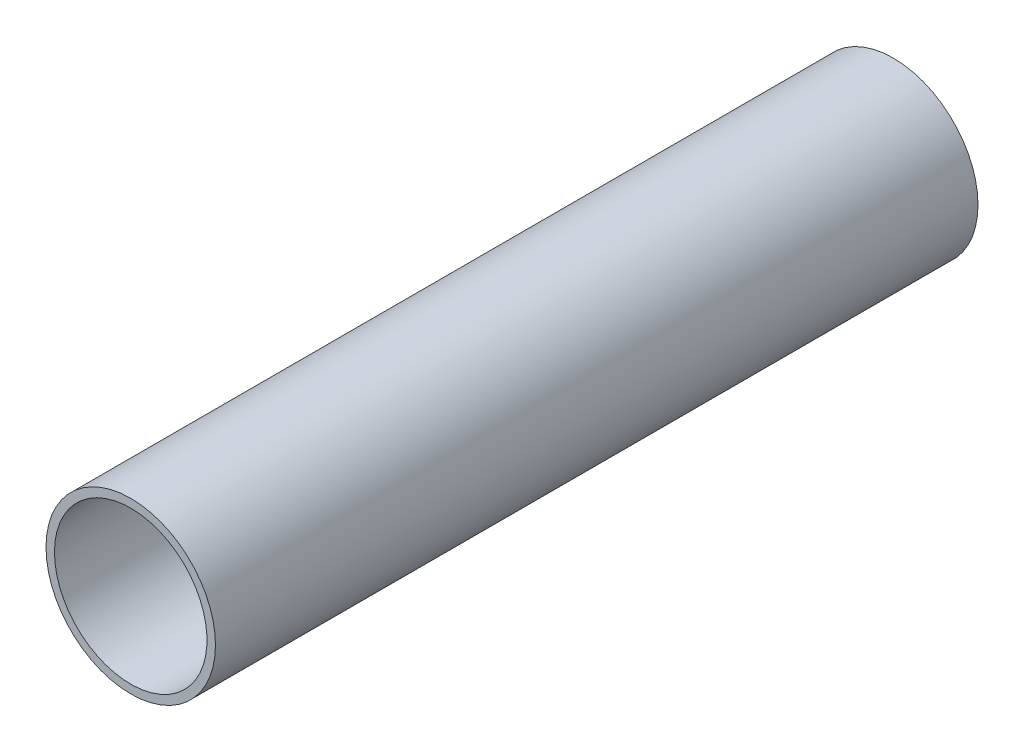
from build123d import *

# Parameters (mm, degrees)
BASE_EXTRUSION_DEPTH      = 22.5
BASE_EXTRUSION_DEPTH_BACK = 22.5
ESQUISSE1_R               = 5
ESQUISSE1_R_2             = 4.5


with BuildPart() as part:
    # Esquisse1 → Base-Extrusion (new, two sides: drawn at the far end of the back side and taken through both)
    with BuildSketch(Plane.XY.offset(-BASE_EXTRUSION_DEPTH_BACK)):
        with Locations(Location((0, 0, 0), (0, 0, 180))):
            Circle(ESQUISSE1_R)
        with Locations(Location((0, 0, 0), (0, 0, 180))):
            Circle(ESQUISSE1_R_2, mode=Mode.SUBTRACT)
    extrude(amount=BASE_EXTRUSION_DEPTH + BASE_EXTRUSION_DEPTH_BACK)


solid = part.part
